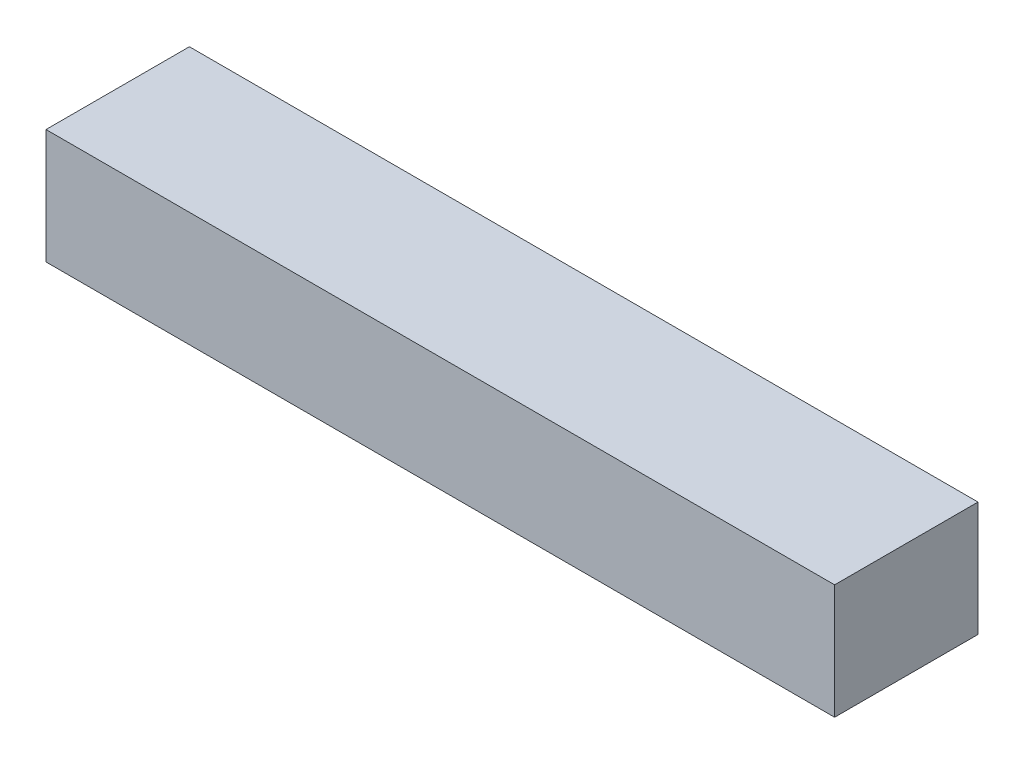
from build123d import *

# Parameters (mm, degrees)
SKETCH1_W           = 55
SKETCH1_H           = 8
BOSS_EXTRUDE1_DEPTH = 10


with BuildPart() as part:
    # Sketch1 → Boss-Extrude1 (new body)
    with BuildSketch(Plane.XY):
        Rectangle(SKETCH1_W, SKETCH1_H)
    extrude(amount=BOSS_EXTRUDE1_DEPTH)


solid = part.part
